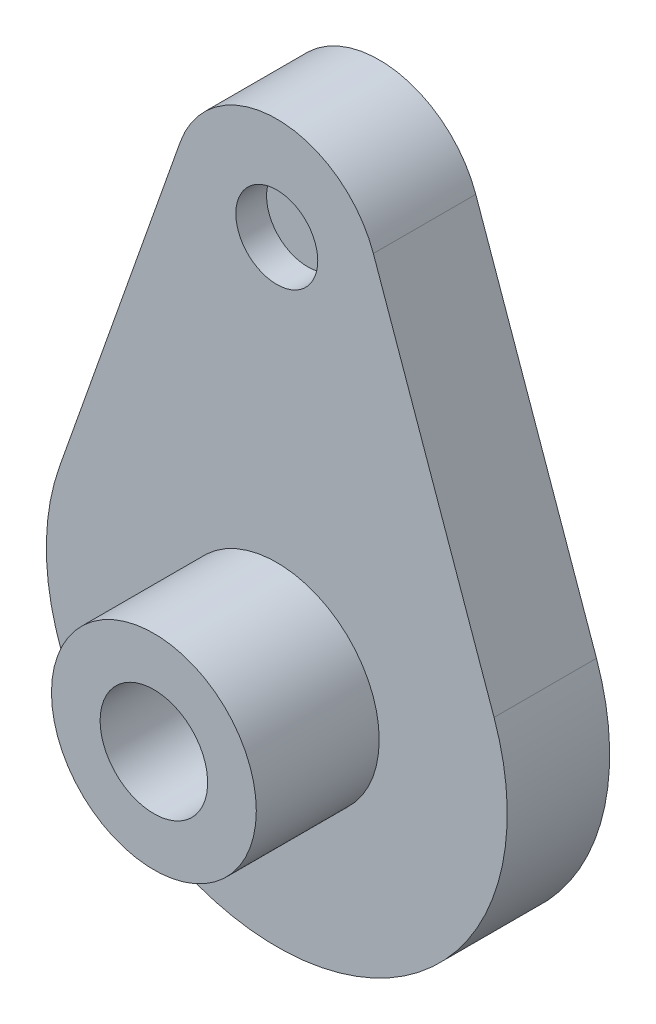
ISO-10303-21;
HEADER;
FILE_DESCRIPTION(('STEP AP214'),'2;1');
FILE_NAME('part.step','',(''),(''),'','','');
FILE_SCHEMA(('AUTOMOTIVE_DESIGN { 1 0 10303 214 1 1 1 1 }'));
ENDSEC;
DATA;
#1=APPLICATION_CONTEXT('core data for automotive mechanical design processes');
#2=APPLICATION_PROTOCOL_DEFINITION('international standard','automotive_design',2000,#1);
#3=PRODUCT_CONTEXT('',#1,'mechanical');
#4=PRODUCT('Part','Part','',(#3));
#5=PRODUCT_RELATED_PRODUCT_CATEGORY('part','',(#4));
#6=PRODUCT_DEFINITION_FORMATION('','',#4);
#7=PRODUCT_DEFINITION_CONTEXT('part definition',#1,'design');
#8=PRODUCT_DEFINITION('design','',#6,#7);
#9=PRODUCT_DEFINITION_SHAPE('','',#8);
#10=(LENGTH_UNIT() NAMED_UNIT(*) SI_UNIT(.MILLI.,.METRE.));
#11=(NAMED_UNIT(*) PLANE_ANGLE_UNIT() SI_UNIT($,.RADIAN.));
#12=(NAMED_UNIT(*) SI_UNIT($,.STERADIAN.) SOLID_ANGLE_UNIT());
#13=UNCERTAINTY_MEASURE_WITH_UNIT(LENGTH_MEASURE(1.E-05),#10,'distance_accuracy_value','');
#14=(GEOMETRIC_REPRESENTATION_CONTEXT(3) GLOBAL_UNCERTAINTY_ASSIGNED_CONTEXT((#13)) GLOBAL_UNIT_ASSIGNED_CONTEXT((#10,
#11,#12)) REPRESENTATION_CONTEXT('',''));
#15=CARTESIAN_POINT('',(0.,0.,0.));
#16=DIRECTION('',(0.,0.,1.));
#17=DIRECTION('',(1.,0.,0.));
#18=AXIS2_PLACEMENT_3D('',#15,#16,#17);
#19=CARTESIAN_POINT('',(0.,15.,8.8));
#20=DIRECTION('',(0.,0.,-1.));
#21=DIRECTION('',(-1.,0.,0.));
#22=AXIS2_PLACEMENT_3D('',#19,#20,#21);
#23=CYLINDRICAL_SURFACE('',#22,1.6);
#24=CARTESIAN_POINT('',(0.,15.,4.));
#25=DIRECTION('',(0.,0.,1.));
#26=DIRECTION('',(1.,0.,0.));
#27=AXIS2_PLACEMENT_3D('',#24,#25,#26);
#28=CIRCLE('',#27,1.6);
#29=CARTESIAN_POINT('',(1.6,15.,4.));
#30=VERTEX_POINT('',#29);
#31=EDGE_CURVE('E169',#30,#30,#28,.T.);
#32=ORIENTED_EDGE('',*,*,#31,.T.);
#33=EDGE_LOOP('',(#32));
#34=FACE_BOUND('',#33,.T.);
#35=CARTESIAN_POINT('',(0.,15.,2.8));
#36=DIRECTION('',(0.,0.,-1.));
#37=DIRECTION('',(-1.,0.,0.));
#38=AXIS2_PLACEMENT_3D('',#35,#36,#37);
#39=CIRCLE('',#38,1.6);
#40=CARTESIAN_POINT('',(-1.6,15.,2.8));
#41=VERTEX_POINT('',#40);
#42=EDGE_CURVE('E11',#41,#41,#39,.F.);
#43=ORIENTED_EDGE('',*,*,#42,.F.);
#44=EDGE_LOOP('',(#43));
#45=FACE_BOUND('',#44,.T.);
#46=ADVANCED_FACE('F35',(#34,#45),#23,.F.);
#47=CARTESIAN_POINT('',(0.,15.,4.));
#48=DIRECTION('',(0.,0.,1.));
#49=DIRECTION('',(1.,0.,0.));
#50=AXIS2_PLACEMENT_3D('',#47,#48,#49);
#51=PLANE('',#50);
#52=ORIENTED_EDGE('',*,*,#31,.F.);
#53=EDGE_LOOP('',(#52));
#54=FACE_BOUND('',#53,.T.);
#55=CARTESIAN_POINT('',(0.,15.,4.));
#56=DIRECTION('',(0.,0.,1.));
#57=DIRECTION('',(1.,0.,0.));
#58=AXIS2_PLACEMENT_3D('',#55,#56,#57);
#59=CIRCLE('',#58,4.);
#60=CARTESIAN_POINT('',(3.77123616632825,16.3333333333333,4.));
#61=VERTEX_POINT('',#60);
#62=CARTESIAN_POINT('',(-3.77123616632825,16.3333333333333,4.));
#63=VERTEX_POINT('',#62);
#64=EDGE_CURVE('E192',#61,#63,#59,.T.);
#65=ORIENTED_EDGE('',*,*,#64,.T.);
#66=DIRECTION('',(-0.333333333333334,-0.942809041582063,0.));
#67=VECTOR('',#66,1.);
#68=CARTESIAN_POINT('',(-3.77123616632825,16.3333333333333,4.));
#69=LINE('',#68,#67);
#70=CARTESIAN_POINT('',(-8.48528137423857,3.,4.));
#71=VERTEX_POINT('',#70);
#72=EDGE_CURVE('E88',#63,#71,#69,.T.);
#73=ORIENTED_EDGE('',*,*,#72,.T.);
#74=CARTESIAN_POINT('',(0.,0.,4.));
#75=DIRECTION('',(0.,0.,1.));
#76=DIRECTION('',(1.,0.,0.));
#77=AXIS2_PLACEMENT_3D('',#74,#75,#76);
#78=CIRCLE('',#77,9.00000000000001);
#79=CARTESIAN_POINT('',(8.48528137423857,3.,4.));
#80=VERTEX_POINT('',#79);
#81=EDGE_CURVE('E195',#71,#80,#78,.T.);
#82=ORIENTED_EDGE('',*,*,#81,.T.);
#83=DIRECTION('',(-0.333333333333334,0.942809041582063,0.));
#84=VECTOR('',#83,1.);
#85=CARTESIAN_POINT('',(3.77123616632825,16.3333333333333,4.));
#86=LINE('',#85,#84);
#87=EDGE_CURVE('E59',#80,#61,#86,.T.);
#88=ORIENTED_EDGE('',*,*,#87,.T.);
#89=EDGE_LOOP('',(#65,#73,#82,#88));
#90=FACE_BOUND('',#89,.T.);
#91=CARTESIAN_POINT('',(0.,0.,4.));
#92=DIRECTION('',(0.,0.,1.));
#93=DIRECTION('',(1.,0.,0.));
#94=AXIS2_PLACEMENT_3D('',#91,#92,#93);
#95=CIRCLE('',#94,4.);
#96=CARTESIAN_POINT('',(4.,0.,4.));
#97=VERTEX_POINT('',#96);
#98=EDGE_CURVE('E183',#97,#97,#95,.T.);
#99=ORIENTED_EDGE('',*,*,#98,.F.);
#100=EDGE_LOOP('',(#99));
#101=FACE_BOUND('',#100,.T.);
#102=ADVANCED_FACE('F224',(#54,#90,#101),#51,.T.);
#103=CARTESIAN_POINT('',(0.,15.,4.));
#104=DIRECTION('',(0.,0.,-1.));
#105=DIRECTION('',(-1.,0.,0.));
#106=AXIS2_PLACEMENT_3D('',#103,#104,#105);
#107=CYLINDRICAL_SURFACE('',#106,4.);
#108=CARTESIAN_POINT('',(0.,15.,0.));
#109=DIRECTION('',(0.,0.,1.));
#110=DIRECTION('',(1.,0.,0.));
#111=AXIS2_PLACEMENT_3D('',#108,#109,#110);
#112=CIRCLE('',#111,4.);
#113=CARTESIAN_POINT('',(3.77123616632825,16.3333333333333,0.));
#114=VERTEX_POINT('',#113);
#115=CARTESIAN_POINT('',(-3.77123616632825,16.3333333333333,0.));
#116=VERTEX_POINT('',#115);
#117=EDGE_CURVE('E189',#114,#116,#112,.T.);
#118=ORIENTED_EDGE('',*,*,#117,.T.);
#119=DIRECTION('',(0.,0.,-1.));
#120=VECTOR('',#119,1.);
#121=CARTESIAN_POINT('',(-3.77123616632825,16.3333333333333,4.));
#122=LINE('',#121,#120);
#123=EDGE_CURVE('E43',#63,#116,#122,.T.);
#124=ORIENTED_EDGE('',*,*,#123,.F.);
#125=ORIENTED_EDGE('',*,*,#64,.F.);
#126=DIRECTION('',(0.,0.,-1.));
#127=VECTOR('',#126,1.);
#128=CARTESIAN_POINT('',(3.77123616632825,16.3333333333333,4.));
#129=LINE('',#128,#127);
#130=EDGE_CURVE('E198',#61,#114,#129,.T.);
#131=ORIENTED_EDGE('',*,*,#130,.T.);
#132=EDGE_LOOP('',(#118,#124,#125,#131));
#133=FACE_BOUND('',#132,.T.);
#134=ADVANCED_FACE('F37',(#133),#107,.T.);
#135=CARTESIAN_POINT('',(-3.77123616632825,16.3333333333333,4.));
#136=DIRECTION('',(0.942809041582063,-0.333333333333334,0.));
#137=DIRECTION('',(0.333333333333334,0.942809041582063,0.));
#138=AXIS2_PLACEMENT_3D('',#135,#136,#137);
#139=PLANE('',#138);
#140=DIRECTION('',(-0.333333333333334,-0.942809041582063,0.));
#141=VECTOR('',#140,1.);
#142=CARTESIAN_POINT('',(-3.77123616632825,16.3333333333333,0.));
#143=LINE('',#142,#141);
#144=CARTESIAN_POINT('',(-8.48528137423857,3.,0.));
#145=VERTEX_POINT('',#144);
#146=EDGE_CURVE('E201',#116,#145,#143,.T.);
#147=ORIENTED_EDGE('',*,*,#146,.T.);
#148=DIRECTION('',(0.,0.,-1.));
#149=VECTOR('',#148,1.);
#150=CARTESIAN_POINT('',(-8.48528137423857,3.,4.));
#151=LINE('',#150,#149);
#152=EDGE_CURVE('E209',#71,#145,#151,.T.);
#153=ORIENTED_EDGE('',*,*,#152,.F.);
#154=ORIENTED_EDGE('',*,*,#72,.F.);
#155=ORIENTED_EDGE('',*,*,#123,.T.);
#156=EDGE_LOOP('',(#147,#153,#154,#155));
#157=FACE_BOUND('',#156,.T.);
#158=ADVANCED_FACE('F212',(#157),#139,.F.);
#159=CARTESIAN_POINT('',(0.,0.,4.));
#160=DIRECTION('',(0.,0.,-1.));
#161=DIRECTION('',(-1.,0.,0.));
#162=AXIS2_PLACEMENT_3D('',#159,#160,#161);
#163=CYLINDRICAL_SURFACE('',#162,9.00000000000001);
#164=CARTESIAN_POINT('',(0.,0.,0.));
#165=DIRECTION('',(0.,0.,1.));
#166=DIRECTION('',(1.,0.,0.));
#167=AXIS2_PLACEMENT_3D('',#164,#165,#166);
#168=CIRCLE('',#167,9.00000000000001);
#169=CARTESIAN_POINT('',(8.48528137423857,3.,0.));
#170=VERTEX_POINT('',#169);
#171=EDGE_CURVE('E203',#145,#170,#168,.T.);
#172=ORIENTED_EDGE('',*,*,#171,.T.);
#173=DIRECTION('',(0.,0.,-1.));
#174=VECTOR('',#173,1.);
#175=CARTESIAN_POINT('',(8.48528137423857,3.,4.));
#176=LINE('',#175,#174);
#177=EDGE_CURVE('E207',#80,#170,#176,.T.);
#178=ORIENTED_EDGE('',*,*,#177,.F.);
#179=ORIENTED_EDGE('',*,*,#81,.F.);
#180=ORIENTED_EDGE('',*,*,#152,.T.);
#181=EDGE_LOOP('',(#172,#178,#179,#180));
#182=FACE_BOUND('',#181,.T.);
#183=ADVANCED_FACE('F221',(#182),#163,.T.);
#184=CARTESIAN_POINT('',(3.77123616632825,16.3333333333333,4.));
#185=DIRECTION('',(-0.942809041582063,-0.333333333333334,0.));
#186=DIRECTION('',(0.333333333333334,-0.942809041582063,0.));
#187=AXIS2_PLACEMENT_3D('',#184,#185,#186);
#188=PLANE('',#187);
#189=DIRECTION('',(-0.333333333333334,0.942809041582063,0.));
#190=VECTOR('',#189,1.);
#191=CARTESIAN_POINT('',(3.77123616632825,16.3333333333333,0.));
#192=LINE('',#191,#190);
#193=EDGE_CURVE('E80',#170,#114,#192,.T.);
#194=ORIENTED_EDGE('',*,*,#193,.T.);
#195=ORIENTED_EDGE('',*,*,#130,.F.);
#196=ORIENTED_EDGE('',*,*,#87,.F.);
#197=ORIENTED_EDGE('',*,*,#177,.T.);
#198=EDGE_LOOP('',(#194,#195,#196,#197));
#199=FACE_BOUND('',#198,.T.);
#200=ADVANCED_FACE('F223',(#199),#188,.F.);
#201=CARTESIAN_POINT('',(0.,15.,0.));
#202=DIRECTION('',(0.,0.,1.));
#203=DIRECTION('',(1.,0.,0.));
#204=AXIS2_PLACEMENT_3D('',#201,#202,#203);
#205=PLANE('',#204);
#206=DIRECTION('',(0.5,0.866025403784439,0.));
#207=VECTOR('',#206,1.);
#208=CARTESIAN_POINT('',(-3.23316150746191,15.,0.));
#209=LINE('',#208,#207);
#210=CARTESIAN_POINT('',(-3.23316150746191,15.,0.));
#211=VERTEX_POINT('',#210);
#212=CARTESIAN_POINT('',(-1.61658075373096,17.8,0.));
#213=VERTEX_POINT('',#212);
#214=EDGE_CURVE('E157',#211,#213,#209,.T.);
#215=ORIENTED_EDGE('',*,*,#214,.F.);
#216=DIRECTION('',(-0.5,0.866025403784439,0.));
#217=VECTOR('',#216,1.);
#218=CARTESIAN_POINT('',(-1.61658075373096,12.2,0.));
#219=LINE('',#218,#217);
#220=CARTESIAN_POINT('',(-1.61658075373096,12.2,0.));
#221=VERTEX_POINT('',#220);
#222=EDGE_CURVE('E50',#221,#211,#219,.T.);
#223=ORIENTED_EDGE('',*,*,#222,.F.);
#224=DIRECTION('',(-1.,0.,0.));
#225=VECTOR('',#224,1.);
#226=CARTESIAN_POINT('',(1.61658075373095,12.2,0.));
#227=LINE('',#226,#225);
#228=CARTESIAN_POINT('',(1.61658075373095,12.2,0.));
#229=VERTEX_POINT('',#228);
#230=EDGE_CURVE('E143',#229,#221,#227,.T.);
#231=ORIENTED_EDGE('',*,*,#230,.F.);
#232=DIRECTION('',(-0.5,-0.866025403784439,0.));
#233=VECTOR('',#232,1.);
#234=CARTESIAN_POINT('',(3.2331615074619,15.,0.));
#235=LINE('',#234,#233);
#236=CARTESIAN_POINT('',(3.2331615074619,15.,0.));
#237=VERTEX_POINT('',#236);
#238=EDGE_CURVE('E146',#237,#229,#235,.T.);
#239=ORIENTED_EDGE('',*,*,#238,.F.);
#240=DIRECTION('',(0.5,-0.866025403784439,0.));
#241=VECTOR('',#240,1.);
#242=CARTESIAN_POINT('',(1.61658075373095,17.8,0.));
#243=LINE('',#242,#241);
#244=CARTESIAN_POINT('',(1.61658075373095,17.8,0.));
#245=VERTEX_POINT('',#244);
#246=EDGE_CURVE('E162',#245,#237,#243,.T.);
#247=ORIENTED_EDGE('',*,*,#246,.F.);
#248=DIRECTION('',(1.,0.,0.));
#249=VECTOR('',#248,1.);
#250=CARTESIAN_POINT('',(-1.61658075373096,17.8,0.));
#251=LINE('',#250,#249);
#252=EDGE_CURVE('E159',#213,#245,#251,.T.);
#253=ORIENTED_EDGE('',*,*,#252,.F.);
#254=EDGE_LOOP('',(#215,#223,#231,#239,#247,#253));
#255=FACE_BOUND('',#254,.T.);
#256=CARTESIAN_POINT('',(0.,0.,0.));
#257=DIRECTION('',(0.,0.,-1.));
#258=DIRECTION('',(-1.,0.,0.));
#259=AXIS2_PLACEMENT_3D('',#256,#257,#258);
#260=CIRCLE('',#259,2.1);
#261=CARTESIAN_POINT('',(-2.1,0.,0.));
#262=VERTEX_POINT('',#261);
#263=EDGE_CURVE('E179',#262,#262,#260,.T.);
#264=ORIENTED_EDGE('',*,*,#263,.F.);
#265=EDGE_LOOP('',(#264));
#266=FACE_BOUND('',#265,.T.);
#267=ORIENTED_EDGE('',*,*,#117,.F.);
#268=ORIENTED_EDGE('',*,*,#193,.F.);
#269=ORIENTED_EDGE('',*,*,#171,.F.);
#270=ORIENTED_EDGE('',*,*,#146,.F.);
#271=EDGE_LOOP('',(#267,#268,#269,#270));
#272=FACE_BOUND('',#271,.T.);
#273=ADVANCED_FACE('F217',(#255,#266,#272),#205,.F.);
#274=CARTESIAN_POINT('',(0.,0.,8.8));
#275=DIRECTION('',(0.,0.,-1.));
#276=DIRECTION('',(-1.,0.,0.));
#277=AXIS2_PLACEMENT_3D('',#274,#275,#276);
#278=CYLINDRICAL_SURFACE('',#277,4.);
#279=CARTESIAN_POINT('',(0.,0.,8.8));
#280=DIRECTION('',(0.,0.,1.));
#281=DIRECTION('',(1.,0.,0.));
#282=AXIS2_PLACEMENT_3D('',#279,#280,#281);
#283=CIRCLE('',#282,4.);
#284=CARTESIAN_POINT('',(4.,0.,8.8));
#285=VERTEX_POINT('',#284);
#286=EDGE_CURVE('E186',#285,#285,#283,.T.);
#287=ORIENTED_EDGE('',*,*,#286,.F.);
#288=EDGE_LOOP('',(#287));
#289=FACE_BOUND('',#288,.T.);
#290=ORIENTED_EDGE('',*,*,#98,.T.);
#291=EDGE_LOOP('',(#290));
#292=FACE_BOUND('',#291,.T.);
#293=ADVANCED_FACE('F231',(#289,#292),#278,.T.);
#294=CARTESIAN_POINT('',(0.,0.,8.8));
#295=DIRECTION('',(0.,0.,1.));
#296=DIRECTION('',(1.,0.,0.));
#297=AXIS2_PLACEMENT_3D('',#294,#295,#296);
#298=PLANE('',#297);
#299=CARTESIAN_POINT('',(0.,0.,8.8));
#300=DIRECTION('',(0.,0.,-1.));
#301=DIRECTION('',(-1.,0.,0.));
#302=AXIS2_PLACEMENT_3D('',#299,#300,#301);
#303=CIRCLE('',#302,2.1);
#304=CARTESIAN_POINT('',(-2.1,0.,8.8));
#305=VERTEX_POINT('',#304);
#306=EDGE_CURVE('E180',#305,#305,#303,.T.);
#307=ORIENTED_EDGE('',*,*,#306,.T.);
#308=EDGE_LOOP('',(#307));
#309=FACE_BOUND('',#308,.T.);
#310=ORIENTED_EDGE('',*,*,#286,.T.);
#311=EDGE_LOOP('',(#310));
#312=FACE_BOUND('',#311,.T.);
#313=ADVANCED_FACE('F233',(#309,#312),#298,.T.);
#314=CARTESIAN_POINT('',(0.,0.,8.8));
#315=DIRECTION('',(0.,0.,-1.));
#316=DIRECTION('',(-1.,0.,0.));
#317=AXIS2_PLACEMENT_3D('',#314,#315,#316);
#318=CYLINDRICAL_SURFACE('',#317,2.1);
#319=ORIENTED_EDGE('',*,*,#306,.F.);
#320=EDGE_LOOP('',(#319));
#321=FACE_BOUND('',#320,.T.);
#322=ORIENTED_EDGE('',*,*,#263,.T.);
#323=EDGE_LOOP('',(#322));
#324=FACE_BOUND('',#323,.T.);
#325=ADVANCED_FACE('F240',(#321,#324),#318,.F.);
#326=CARTESIAN_POINT('',(0.,0.,2.6));
#327=DIRECTION('',(0.,0.,-1.));
#328=DIRECTION('',(-1.,0.,0.));
#329=AXIS2_PLACEMENT_3D('',#326,#327,#328);
#330=PLANE('',#329);
#331=DIRECTION('',(-0.5,0.866025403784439,0.));
#332=VECTOR('',#331,1.);
#333=CARTESIAN_POINT('',(-1.61658075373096,12.2,2.6));
#334=LINE('',#333,#332);
#335=CARTESIAN_POINT('',(-1.61658075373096,12.2,2.6));
#336=VERTEX_POINT('',#335);
#337=CARTESIAN_POINT('',(-3.23316150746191,15.,2.6));
#338=VERTEX_POINT('',#337);
#339=EDGE_CURVE('E124',#336,#338,#334,.T.);
#340=ORIENTED_EDGE('',*,*,#339,.T.);
#341=DIRECTION('',(0.5,0.866025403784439,0.));
#342=VECTOR('',#341,1.);
#343=CARTESIAN_POINT('',(-3.23316150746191,15.,2.6));
#344=LINE('',#343,#342);
#345=CARTESIAN_POINT('',(-1.61658075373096,17.8,2.6));
#346=VERTEX_POINT('',#345);
#347=EDGE_CURVE('E133',#338,#346,#344,.T.);
#348=ORIENTED_EDGE('',*,*,#347,.T.);
#349=DIRECTION('',(1.,0.,0.));
#350=VECTOR('',#349,1.);
#351=CARTESIAN_POINT('',(-1.61658075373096,17.8,2.6));
#352=LINE('',#351,#350);
#353=CARTESIAN_POINT('',(1.61658075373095,17.8,2.6));
#354=VERTEX_POINT('',#353);
#355=EDGE_CURVE('E138',#346,#354,#352,.T.);
#356=ORIENTED_EDGE('',*,*,#355,.T.);
#357=DIRECTION('',(0.5,-0.866025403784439,0.));
#358=VECTOR('',#357,1.);
#359=CARTESIAN_POINT('',(1.61658075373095,17.8,2.6));
#360=LINE('',#359,#358);
#361=CARTESIAN_POINT('',(3.2331615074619,15.,2.6));
#362=VERTEX_POINT('',#361);
#363=EDGE_CURVE('E150',#354,#362,#360,.T.);
#364=ORIENTED_EDGE('',*,*,#363,.T.);
#365=DIRECTION('',(-0.5,-0.866025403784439,0.));
#366=VECTOR('',#365,1.);
#367=CARTESIAN_POINT('',(3.2331615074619,15.,2.6));
#368=LINE('',#367,#366);
#369=CARTESIAN_POINT('',(1.61658075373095,12.2,2.6));
#370=VERTEX_POINT('',#369);
#371=EDGE_CURVE('E153',#362,#370,#368,.T.);
#372=ORIENTED_EDGE('',*,*,#371,.T.);
#373=DIRECTION('',(-1.,0.,0.));
#374=VECTOR('',#373,1.);
#375=CARTESIAN_POINT('',(1.61658075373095,12.2,2.6));
#376=LINE('',#375,#374);
#377=EDGE_CURVE('E130',#370,#336,#376,.T.);
#378=ORIENTED_EDGE('',*,*,#377,.T.);
#379=EDGE_LOOP('',(#340,#348,#356,#364,#372,#378));
#380=FACE_BOUND('',#379,.T.);
#381=ADVANCED_FACE('F140',(#380),#330,.T.);
#382=CARTESIAN_POINT('',(-1.61658075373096,12.2,2.6));
#383=DIRECTION('',(-0.866025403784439,-0.5,0.));
#384=DIRECTION('',(0.5,-0.866025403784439,0.));
#385=AXIS2_PLACEMENT_3D('',#382,#383,#384);
#386=PLANE('',#385);
#387=ORIENTED_EDGE('',*,*,#222,.T.);
#388=DIRECTION('',(0.,0.,-1.));
#389=VECTOR('',#388,1.);
#390=CARTESIAN_POINT('',(-3.23316150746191,15.,2.6));
#391=LINE('',#390,#389);
#392=EDGE_CURVE('E120',#338,#211,#391,.T.);
#393=ORIENTED_EDGE('',*,*,#392,.F.);
#394=ORIENTED_EDGE('',*,*,#339,.F.);
#395=DIRECTION('',(0.,0.,-1.));
#396=VECTOR('',#395,1.);
#397=CARTESIAN_POINT('',(-1.61658075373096,12.2,2.6));
#398=LINE('',#397,#396);
#399=EDGE_CURVE('E167',#336,#221,#398,.T.);
#400=ORIENTED_EDGE('',*,*,#399,.T.);
#401=EDGE_LOOP('',(#387,#393,#394,#400));
#402=FACE_BOUND('',#401,.T.);
#403=ADVANCED_FACE('F122',(#402),#386,.F.);
#404=CARTESIAN_POINT('',(1.61658075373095,12.2,2.6));
#405=DIRECTION('',(0.,-1.,0.));
#406=DIRECTION('',(0.,0.,-1.));
#407=AXIS2_PLACEMENT_3D('',#404,#405,#406);
#408=PLANE('',#407);
#409=ORIENTED_EDGE('',*,*,#230,.T.);
#410=ORIENTED_EDGE('',*,*,#399,.F.);
#411=ORIENTED_EDGE('',*,*,#377,.F.);
#412=DIRECTION('',(0.,0.,-1.));
#413=VECTOR('',#412,1.);
#414=CARTESIAN_POINT('',(1.61658075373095,12.2,2.6));
#415=LINE('',#414,#413);
#416=EDGE_CURVE('E170',#370,#229,#415,.T.);
#417=ORIENTED_EDGE('',*,*,#416,.T.);
#418=EDGE_LOOP('',(#409,#410,#411,#417));
#419=FACE_BOUND('',#418,.T.);
#420=ADVANCED_FACE('F272',(#419),#408,.F.);
#421=CARTESIAN_POINT('',(3.2331615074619,15.,2.6));
#422=DIRECTION('',(0.866025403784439,-0.5,0.));
#423=DIRECTION('',(0.5,0.866025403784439,0.));
#424=AXIS2_PLACEMENT_3D('',#421,#422,#423);
#425=PLANE('',#424);
#426=ORIENTED_EDGE('',*,*,#238,.T.);
#427=ORIENTED_EDGE('',*,*,#416,.F.);
#428=ORIENTED_EDGE('',*,*,#371,.F.);
#429=DIRECTION('',(0.,0.,-1.));
#430=VECTOR('',#429,1.);
#431=CARTESIAN_POINT('',(3.2331615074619,15.,2.6));
#432=LINE('',#431,#430);
#433=EDGE_CURVE('E172',#362,#237,#432,.T.);
#434=ORIENTED_EDGE('',*,*,#433,.T.);
#435=EDGE_LOOP('',(#426,#427,#428,#434));
#436=FACE_BOUND('',#435,.T.);
#437=ADVANCED_FACE('F278',(#436),#425,.F.);
#438=CARTESIAN_POINT('',(1.61658075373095,17.8,2.6));
#439=DIRECTION('',(0.866025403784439,0.5,0.));
#440=DIRECTION('',(-0.5,0.866025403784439,0.));
#441=AXIS2_PLACEMENT_3D('',#438,#439,#440);
#442=PLANE('',#441);
#443=ORIENTED_EDGE('',*,*,#246,.T.);
#444=ORIENTED_EDGE('',*,*,#433,.F.);
#445=ORIENTED_EDGE('',*,*,#363,.F.);
#446=DIRECTION('',(0.,0.,-1.));
#447=VECTOR('',#446,1.);
#448=CARTESIAN_POINT('',(1.61658075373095,17.8,2.6));
#449=LINE('',#448,#447);
#450=EDGE_CURVE('E174',#354,#245,#449,.T.);
#451=ORIENTED_EDGE('',*,*,#450,.T.);
#452=EDGE_LOOP('',(#443,#444,#445,#451));
#453=FACE_BOUND('',#452,.T.);
#454=ADVANCED_FACE('F282',(#453),#442,.F.);
#455=CARTESIAN_POINT('',(-1.61658075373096,17.8,2.6));
#456=DIRECTION('',(0.,1.,0.));
#457=DIRECTION('',(0.,0.,1.));
#458=AXIS2_PLACEMENT_3D('',#455,#456,#457);
#459=PLANE('',#458);
#460=ORIENTED_EDGE('',*,*,#252,.T.);
#461=ORIENTED_EDGE('',*,*,#450,.F.);
#462=ORIENTED_EDGE('',*,*,#355,.F.);
#463=DIRECTION('',(0.,0.,-1.));
#464=VECTOR('',#463,1.);
#465=CARTESIAN_POINT('',(-1.61658075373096,17.8,2.6));
#466=LINE('',#465,#464);
#467=EDGE_CURVE('E129',#346,#213,#466,.T.);
#468=ORIENTED_EDGE('',*,*,#467,.T.);
#469=EDGE_LOOP('',(#460,#461,#462,#468));
#470=FACE_BOUND('',#469,.T.);
#471=ADVANCED_FACE('F286',(#470),#459,.F.);
#472=CARTESIAN_POINT('',(-3.23316150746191,15.,2.6));
#473=DIRECTION('',(-0.866025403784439,0.5,0.));
#474=DIRECTION('',(-0.5,-0.866025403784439,0.));
#475=AXIS2_PLACEMENT_3D('',#472,#473,#474);
#476=PLANE('',#475);
#477=ORIENTED_EDGE('',*,*,#214,.T.);
#478=ORIENTED_EDGE('',*,*,#467,.F.);
#479=ORIENTED_EDGE('',*,*,#347,.F.);
#480=ORIENTED_EDGE('',*,*,#392,.T.);
#481=EDGE_LOOP('',(#477,#478,#479,#480));
#482=FACE_BOUND('',#481,.T.);
#483=ADVANCED_FACE('F134',(#482),#476,.F.);
#484=CARTESIAN_POINT('',(0.,15.,2.8));
#485=DIRECTION('',(0.,0.,-1.));
#486=DIRECTION('',(-1.,0.,0.));
#487=AXIS2_PLACEMENT_3D('',#484,#485,#486);
#488=PLANE('',#487);
#489=ORIENTED_EDGE('',*,*,#42,.T.);
#490=EDGE_LOOP('',(#489));
#491=FACE_BOUND('',#490,.T.);
#492=ADVANCED_FACE('F275',(#491),#488,.F.);
#493=CLOSED_SHELL('',(#46,#102,#134,#158,#183,#200,#273,#293,#313,#325,#381,#403,#420,#437,#454,
#471,#483,#492));
#494=MANIFOLD_SOLID_BREP('B2',#493);
#495=ADVANCED_BREP_SHAPE_REPRESENTATION('',(#18,#494),#14);
#496=SHAPE_DEFINITION_REPRESENTATION(#9,#495);
ENDSEC;
END-ISO-10303-21;
